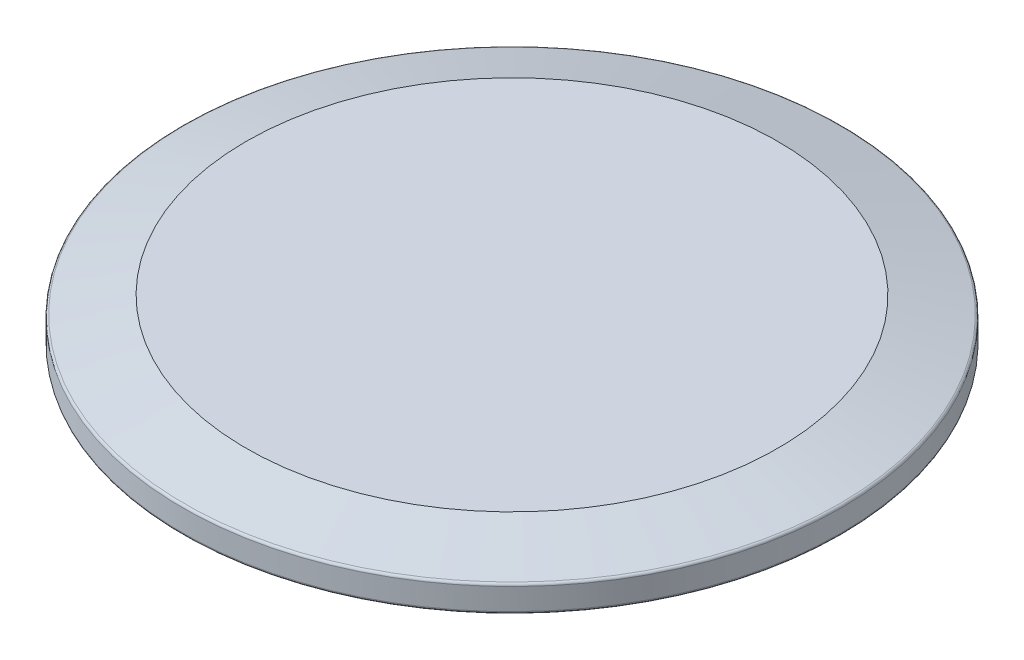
ISO-10303-21;
HEADER;
FILE_DESCRIPTION(('STEP AP214'),'2;1');
FILE_NAME('part.step','',(''),(''),'','','');
FILE_SCHEMA(('AUTOMOTIVE_DESIGN { 1 0 10303 214 1 1 1 1 }'));
ENDSEC;
DATA;
#1=APPLICATION_CONTEXT('core data for automotive mechanical design processes');
#2=APPLICATION_PROTOCOL_DEFINITION('international standard','automotive_design',2000,#1);
#3=PRODUCT_CONTEXT('',#1,'mechanical');
#4=PRODUCT('Part','Part','',(#3));
#5=PRODUCT_RELATED_PRODUCT_CATEGORY('part','',(#4));
#6=PRODUCT_DEFINITION_FORMATION('','',#4);
#7=PRODUCT_DEFINITION_CONTEXT('part definition',#1,'design');
#8=PRODUCT_DEFINITION('design','',#6,#7);
#9=PRODUCT_DEFINITION_SHAPE('','',#8);
#10=(LENGTH_UNIT() NAMED_UNIT(*) SI_UNIT(.MILLI.,.METRE.));
#11=(NAMED_UNIT(*) PLANE_ANGLE_UNIT() SI_UNIT($,.RADIAN.));
#12=(NAMED_UNIT(*) SI_UNIT($,.STERADIAN.) SOLID_ANGLE_UNIT());
#13=UNCERTAINTY_MEASURE_WITH_UNIT(LENGTH_MEASURE(1.E-05),#10,'distance_accuracy_value','');
#14=(GEOMETRIC_REPRESENTATION_CONTEXT(3) GLOBAL_UNCERTAINTY_ASSIGNED_CONTEXT((#13)) GLOBAL_UNIT_ASSIGNED_CONTEXT((#10,
#11,#12)) REPRESENTATION_CONTEXT('',''));
#15=CARTESIAN_POINT('',(0.,0.,0.));
#16=DIRECTION('',(0.,0.,1.));
#17=DIRECTION('',(1.,0.,0.));
#18=AXIS2_PLACEMENT_3D('',#15,#16,#17);
#19=CARTESIAN_POINT('',(0.,0.299999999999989,0.));
#20=DIRECTION('',(0.,1.,0.));
#21=DIRECTION('',(-1.,0.,0.));
#22=AXIS2_PLACEMENT_3D('',#19,#20,#21);
#23=TOROIDAL_SURFACE('',#22,26.6,0.3);
#24=CARTESIAN_POINT('',(0.,0.,0.));
#25=DIRECTION('',(0.,1.,0.));
#26=DIRECTION('',(-1.,0.,0.));
#27=AXIS2_PLACEMENT_3D('',#24,#25,#26);
#28=CIRCLE('',#27,26.6);
#29=CARTESIAN_POINT('',(-26.6,0.,0.));
#30=VERTEX_POINT('',#29);
#31=EDGE_CURVE('E54',#30,#30,#28,.T.);
#32=ORIENTED_EDGE('',*,*,#31,.F.);
#33=EDGE_LOOP('',(#32));
#34=FACE_BOUND('',#33,.T.);
#35=CARTESIAN_POINT('',(0.,0.299999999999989,0.));
#36=DIRECTION('',(0.,1.,0.));
#37=DIRECTION('',(-1.,0.,0.));
#38=AXIS2_PLACEMENT_3D('',#35,#36,#37);
#39=CIRCLE('',#38,26.3);
#40=CARTESIAN_POINT('',(-26.3,0.299999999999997,0.));
#41=VERTEX_POINT('',#40);
#42=EDGE_CURVE('E10',#41,#41,#39,.F.);
#43=ORIENTED_EDGE('',*,*,#42,.F.);
#44=EDGE_LOOP('',(#43));
#45=FACE_BOUND('',#44,.T.);
#46=ADVANCED_FACE('F47',(#34,#45),#23,.T.);
#47=CARTESIAN_POINT('',(0.,0.299999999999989,0.));
#48=DIRECTION('',(0.,1.,0.));
#49=DIRECTION('',(-1.,0.,0.));
#50=AXIS2_PLACEMENT_3D('',#47,#48,#49);
#51=TOROIDAL_SURFACE('',#50,37.2,0.3);
#52=CARTESIAN_POINT('',(0.,0.299999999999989,0.));
#53=DIRECTION('',(0.,1.,0.));
#54=DIRECTION('',(-1.,0.,0.));
#55=AXIS2_PLACEMENT_3D('',#52,#53,#54);
#56=CIRCLE('',#55,37.5);
#57=CARTESIAN_POINT('',(-37.5,0.3,0.));
#58=VERTEX_POINT('',#57);
#59=EDGE_CURVE('E64',#58,#58,#56,.T.);
#60=ORIENTED_EDGE('',*,*,#59,.F.);
#61=EDGE_LOOP('',(#60));
#62=FACE_BOUND('',#61,.T.);
#63=CARTESIAN_POINT('',(0.,0.,0.));
#64=DIRECTION('',(0.,1.,0.));
#65=DIRECTION('',(-1.,0.,0.));
#66=AXIS2_PLACEMENT_3D('',#63,#64,#65);
#67=CIRCLE('',#66,37.2);
#68=CARTESIAN_POINT('',(-37.2,0.,0.));
#69=VERTEX_POINT('',#68);
#70=EDGE_CURVE('E59',#69,#69,#67,.F.);
#71=ORIENTED_EDGE('',*,*,#70,.F.);
#72=EDGE_LOOP('',(#71));
#73=FACE_BOUND('',#72,.T.);
#74=ADVANCED_FACE('F110',(#62,#73),#51,.T.);
#75=CARTESIAN_POINT('',(0.,2.77155291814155,0.));
#76=DIRECTION('',(0.,-1.,0.));
#77=DIRECTION('',(1.,0.,0.));
#78=AXIS2_PLACEMENT_3D('',#75,#76,#77);
#79=TOROIDAL_SURFACE('',#78,37.2,0.3);
#80=CARTESIAN_POINT('',(0.,3.06075070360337,0.));
#81=DIRECTION('',(0.,1.,0.));
#82=DIRECTION('',(-1.,0.,0.));
#83=AXIS2_PLACEMENT_3D('',#80,#81,#82);
#84=CIRCLE('',#83,37.2797786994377);
#85=CARTESIAN_POINT('',(-37.2797786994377,3.06075070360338,0.));
#86=VERTEX_POINT('',#85);
#87=EDGE_CURVE('E74',#86,#86,#84,.T.);
#88=ORIENTED_EDGE('',*,*,#87,.F.);
#89=EDGE_LOOP('',(#88));
#90=FACE_BOUND('',#89,.T.);
#91=CARTESIAN_POINT('',(0.,2.77155291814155,0.));
#92=DIRECTION('',(0.,-1.,0.));
#93=DIRECTION('',(1.,0.,0.));
#94=AXIS2_PLACEMENT_3D('',#91,#92,#93);
#95=CIRCLE('',#94,37.5);
#96=CARTESIAN_POINT('',(37.5,2.77155291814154,0.));
#97=VERTEX_POINT('',#96);
#98=EDGE_CURVE('E70',#97,#97,#95,.T.);
#99=ORIENTED_EDGE('',*,*,#98,.F.);
#100=EDGE_LOOP('',(#99));
#101=FACE_BOUND('',#100,.T.);
#102=ADVANCED_FACE('F100',(#90,#101),#79,.T.);
#103=CARTESIAN_POINT('',(0.,2.49999999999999,0.));
#104=DIRECTION('',(0.,-1.,0.));
#105=DIRECTION('',(1.,0.,0.));
#106=AXIS2_PLACEMENT_3D('',#103,#104,#105);
#107=PLANE('',#106);
#108=CARTESIAN_POINT('',(0.,2.49999999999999,0.));
#109=DIRECTION('',(0.,1.,0.));
#110=DIRECTION('',(-1.,0.,0.));
#111=AXIS2_PLACEMENT_3D('',#108,#109,#110);
#112=CIRCLE('',#111,23.1);
#113=CARTESIAN_POINT('',(-23.1,2.5,0.));
#114=VERTEX_POINT('',#113);
#115=EDGE_CURVE('E78',#114,#114,#112,.T.);
#116=ORIENTED_EDGE('',*,*,#115,.T.);
#117=EDGE_LOOP('',(#116));
#118=FACE_BOUND('',#117,.T.);
#119=CARTESIAN_POINT('',(0.,2.49999999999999,0.));
#120=DIRECTION('',(0.,1.,0.));
#121=DIRECTION('',(-1.,0.,0.));
#122=AXIS2_PLACEMENT_3D('',#119,#120,#121);
#123=CIRCLE('',#122,26.3);
#124=CARTESIAN_POINT('',(-26.3,2.5,0.));
#125=VERTEX_POINT('',#124);
#126=EDGE_CURVE('E90',#125,#125,#123,.T.);
#127=ORIENTED_EDGE('',*,*,#126,.F.);
#128=EDGE_LOOP('',(#127));
#129=FACE_BOUND('',#128,.T.);
#130=ADVANCED_FACE('F97',(#118,#129),#107,.T.);
#131=CARTESIAN_POINT('',(0.,5.,0.));
#132=DIRECTION('',(0.,1.,0.));
#133=DIRECTION('',(-1.,0.,0.));
#134=AXIS2_PLACEMENT_3D('',#131,#132,#133);
#135=CYLINDRICAL_SURFACE('',#134,23.1);
#136=CARTESIAN_POINT('',(0.,0.,0.));
#137=DIRECTION('',(0.,1.,0.));
#138=DIRECTION('',(-1.,0.,0.));
#139=AXIS2_PLACEMENT_3D('',#136,#137,#138);
#140=CIRCLE('',#139,23.1);
#141=CARTESIAN_POINT('',(-23.1,0.,0.));
#142=VERTEX_POINT('',#141);
#143=EDGE_CURVE('E82',#142,#142,#140,.T.);
#144=ORIENTED_EDGE('',*,*,#143,.T.);
#145=EDGE_LOOP('',(#144));
#146=FACE_BOUND('',#145,.T.);
#147=ORIENTED_EDGE('',*,*,#115,.F.);
#148=EDGE_LOOP('',(#147));
#149=FACE_BOUND('',#148,.T.);
#150=ADVANCED_FACE('F99',(#146,#149),#135,.T.);
#151=CARTESIAN_POINT('',(0.,0.,0.));
#152=DIRECTION('',(0.,1.,0.));
#153=DIRECTION('',(-1.,0.,0.));
#154=AXIS2_PLACEMENT_3D('',#151,#152,#153);
#155=PLANE('',#154);
#156=ORIENTED_EDGE('',*,*,#143,.F.);
#157=EDGE_LOOP('',(#156));
#158=FACE_BOUND('',#157,.T.);
#159=ADVANCED_FACE('F106',(#158),#155,.F.);
#160=CARTESIAN_POINT('',(0.,5.,0.));
#161=DIRECTION('',(0.,-1.,0.));
#162=DIRECTION('',(1.,0.,0.));
#163=AXIS2_PLACEMENT_3D('',#160,#161,#162);
#164=PLANE('',#163);
#165=CARTESIAN_POINT('',(0.,4.99999999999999,0.));
#166=DIRECTION('',(0.,1.,0.));
#167=DIRECTION('',(-1.,0.,0.));
#168=AXIS2_PLACEMENT_3D('',#165,#166,#167);
#169=CIRCLE('',#168,30.25);
#170=CARTESIAN_POINT('',(-30.25,5.,0.));
#171=VERTEX_POINT('',#170);
#172=EDGE_CURVE('E86',#171,#171,#169,.T.);
#173=ORIENTED_EDGE('',*,*,#172,.T.);
#174=EDGE_LOOP('',(#173));
#175=FACE_BOUND('',#174,.T.);
#176=ADVANCED_FACE('F141',(#175),#164,.F.);
#177=CARTESIAN_POINT('',(0.,2.99999999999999,0.));
#178=DIRECTION('',(0.,-1.,0.));
#179=DIRECTION('',(1.,0.,0.));
#180=AXIS2_PLACEMENT_3D('',#177,#178,#179);
#181=CONICAL_SURFACE('',#180,37.5,1.3016288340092);
#182=ORIENTED_EDGE('',*,*,#87,.T.);
#183=EDGE_LOOP('',(#182));
#184=FACE_BOUND('',#183,.T.);
#185=ORIENTED_EDGE('',*,*,#172,.F.);
#186=EDGE_LOOP('',(#185));
#187=FACE_BOUND('',#186,.T.);
#188=ADVANCED_FACE('F136',(#184,#187),#181,.T.);
#189=CARTESIAN_POINT('',(0.,5.,0.));
#190=DIRECTION('',(0.,1.,0.));
#191=DIRECTION('',(-1.,0.,0.));
#192=AXIS2_PLACEMENT_3D('',#189,#190,#191);
#193=CYLINDRICAL_SURFACE('',#192,37.5);
#194=ORIENTED_EDGE('',*,*,#59,.T.);
#195=EDGE_LOOP('',(#194));
#196=FACE_BOUND('',#195,.T.);
#197=ORIENTED_EDGE('',*,*,#98,.T.);
#198=EDGE_LOOP('',(#197));
#199=FACE_BOUND('',#198,.T.);
#200=ADVANCED_FACE('F130',(#196,#199),#193,.T.);
#201=CARTESIAN_POINT('',(0.,0.,0.));
#202=DIRECTION('',(0.,1.,0.));
#203=DIRECTION('',(-1.,0.,0.));
#204=AXIS2_PLACEMENT_3D('',#201,#202,#203);
#205=PLANE('',#204);
#206=ORIENTED_EDGE('',*,*,#31,.T.);
#207=EDGE_LOOP('',(#206));
#208=FACE_BOUND('',#207,.T.);
#209=ORIENTED_EDGE('',*,*,#70,.T.);
#210=EDGE_LOOP('',(#209));
#211=FACE_BOUND('',#210,.T.);
#212=ADVANCED_FACE('F129',(#208,#211),#205,.F.);
#213=CARTESIAN_POINT('',(0.,5.,0.));
#214=DIRECTION('',(0.,1.,0.));
#215=DIRECTION('',(-1.,0.,0.));
#216=AXIS2_PLACEMENT_3D('',#213,#214,#215);
#217=CYLINDRICAL_SURFACE('',#216,26.3);
#218=ORIENTED_EDGE('',*,*,#42,.T.);
#219=EDGE_LOOP('',(#218));
#220=FACE_BOUND('',#219,.T.);
#221=ORIENTED_EDGE('',*,*,#126,.T.);
#222=EDGE_LOOP('',(#221));
#223=FACE_BOUND('',#222,.T.);
#224=ADVANCED_FACE('F95',(#220,#223),#217,.F.);
#225=CLOSED_SHELL('',(#46,#74,#102,#130,#150,#159,#176,#188,#200,#212,#224));
#226=MANIFOLD_SOLID_BREP('B2',#225);
#227=ADVANCED_BREP_SHAPE_REPRESENTATION('',(#18,#226),#14);
#228=SHAPE_DEFINITION_REPRESENTATION(#9,#227);
ENDSEC;
END-ISO-10303-21;
